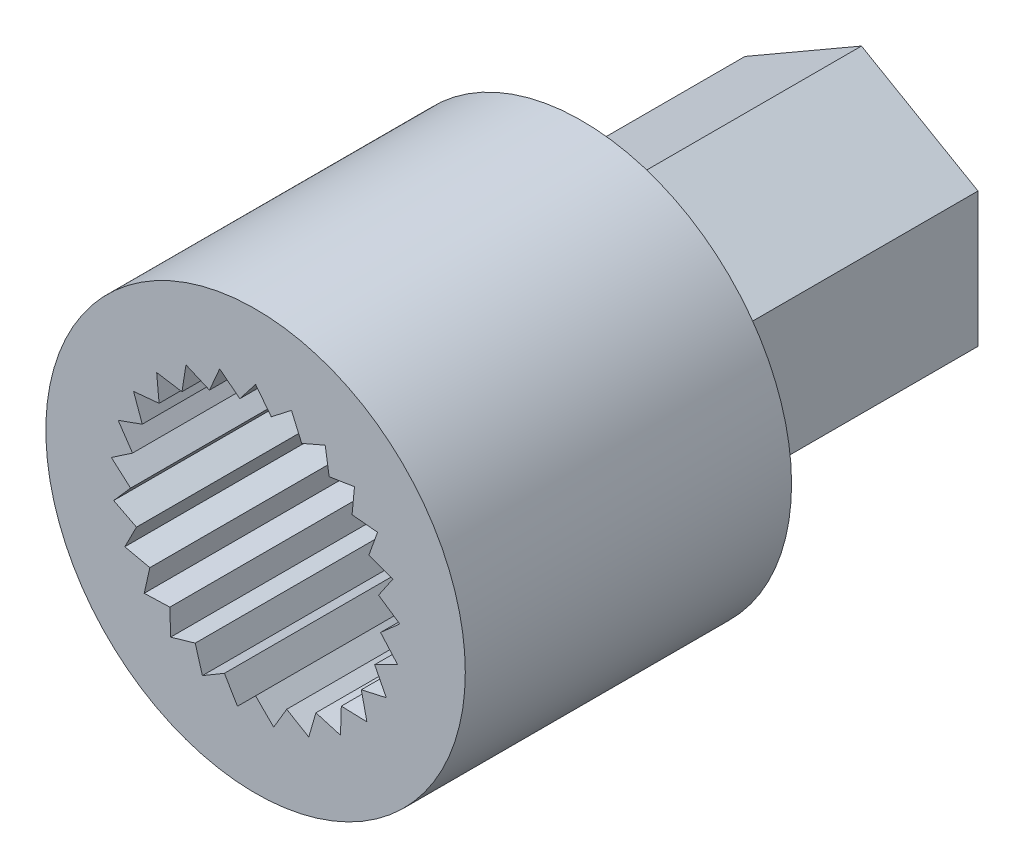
from build123d import *

# Parameters (mm, degrees)
SKIZZE1_R                       = 2.25
AUFSATZ_LINEAR_AUSTRAGEN1_DEPTH = 2.5
AUFSATZ_LINEAR_START            = -1
SKIZZE2_R                       = 2.25
AUFSATZ_LINEAR_AUSTRAGEN2_DEPTH = 1
AUFSATZ_LINEAR_AUSTRAGEN3_DEPTH = 3


with BuildPart() as part:
    # Skizze1 → Aufsatz-Linear austragen1 (new body)
    with BuildSketch(Plane.XY):
        Circle(SKIZZE1_R)
        Polygon((0, 1.55), (0.168386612, 1.332917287), (0.385469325, 1.5013039), (0.494579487, 1.249165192), (0.746718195, 1.358275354), (0.789696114, 1.086923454), (1.061048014, 1.129901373), (1.035193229, 0.856386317), (1.308708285, 0.830531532), (1.215645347, 0.572039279), (1.4741376, 0.478976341), (1.319713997, 0.251748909), (1.546941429, 0.097325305), (1.340860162, -0.084359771), (1.522545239, -0.290441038), (1.277755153, -0.415167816), (1.402481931, -0.659957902), (1.134364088, -0.719889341), (1.194295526, -0.988007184), (0.919696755, -0.97937757), (0.911067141, -1.253976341), (0.647241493, -1.177327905), (0.570593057, -1.441153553), (0.334117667, -1.301302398), (0.194266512, -1.537777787), (0, -1.343511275), (-0.194266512, -1.537777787), (-0.334117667, -1.301302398), (-0.570593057, -1.441153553), (-0.647241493, -1.177327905), (-0.911067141, -1.253976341), (-0.919696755, -0.97937757), (-1.194295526, -0.988007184), (-1.134364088, -0.719889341), (-1.402481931, -0.659957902), (-1.277755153, -0.415167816), (-1.522545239, -0.290441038), (-1.340860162, -0.084359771), (-1.546941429, 0.097325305), (-1.319713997, 0.251748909), (-1.4741376, 0.478976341), (-1.215645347, 0.572039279), (-1.308708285, 0.830531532), (-1.035193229, 0.856386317), (-1.061048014, 1.129901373), (-0.789696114, 1.086923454), (-0.746718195, 1.358275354), (-0.494579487, 1.249165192), (-0.385469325, 1.5013039), (-0.168386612, 1.332917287), align=None, mode=Mode.SUBTRACT)
    extrude(amount=AUFSATZ_LINEAR_AUSTRAGEN1_DEPTH)

    # Skizze2 → Aufsatz-Linear austragen2 (add)
    with BuildSketch(Plane.XY.offset(AUFSATZ_LINEAR_START)):
        Circle(SKIZZE2_R)
    extrude(amount=AUFSATZ_LINEAR_AUSTRAGEN2_DEPTH)

    # Skizze3 → Aufsatz-Linear austragen3 (add)
    with BuildSketch(Plane(origin=(0, 0, -1), x_dir=(-1, 0, 0), z_dir=(0, 0, -1))):
        Polygon((0, -1.443375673), (-1.25, -0.721687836), (-1.25, 0.721687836), (0, 1.443375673), (1.25, 0.721687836), (1.25, -0.721687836), align=None)
    extrude(amount=AUFSATZ_LINEAR_AUSTRAGEN3_DEPTH)


solid = part.part
